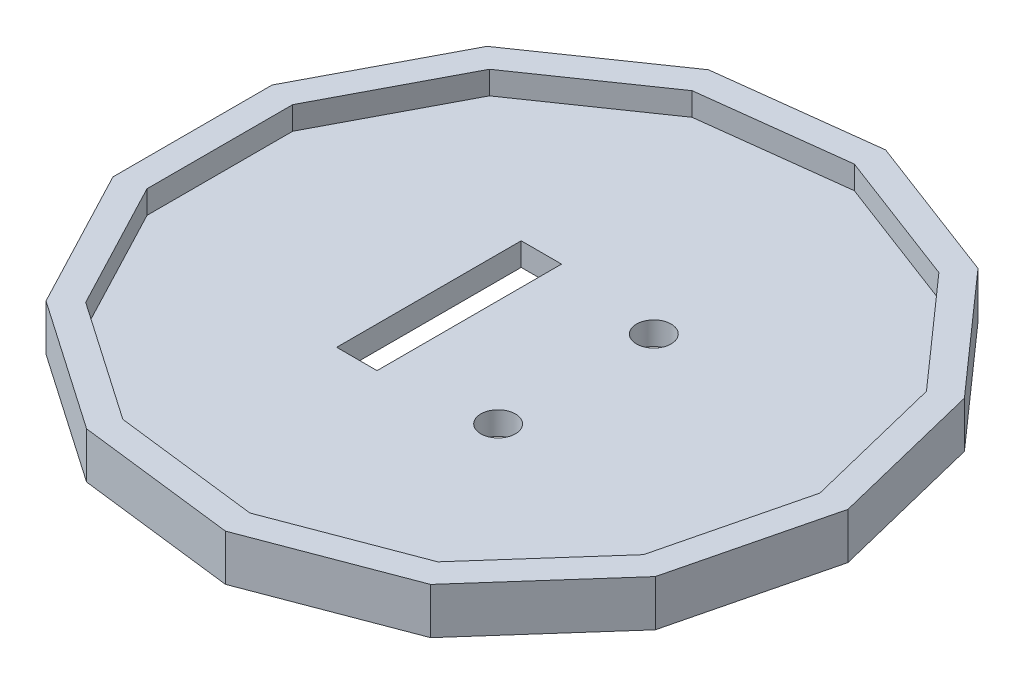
from build123d import *

# Parameters (mm, degrees)
SENSOR_BLOCK_DEPTH    = 4
SENSOR_BASE_CUT_DEPTH = 2
SKETCH9_R             = 1.5
SKETCH9_W             = 3.5
SKETCH9_H             = 16
SENSOR_HOLES_DEPTH    = 2


with BuildPart() as part:
    # Sketch5 → Sensor Block (new body)
    with BuildSketch(Plane(origin=(0, 0, 0), x_dir=(1, 0, 0), z_dir=(0, 1, 0))):
        Polygon((-21.585537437, 19.12311747), (-28, 6.901380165), (-28, -6.901380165), (-21.585537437, -19.12311747), (-10.22608838, -26.96397902), (3.476034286, -28.627717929), (16.381839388, -23.733191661), (25.534762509, -13.4016772), (28.837979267, 0), (25.534762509, 13.4016772), (16.381839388, 23.733191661), (3.476034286, 28.627717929), (-10.22608838, 26.96397902), align=None)
    extrude(amount=SENSOR_BLOCK_DEPTH)

    # Sketch7 → Sensor Base Cut (cut)
    with BuildSketch(Plane(origin=(0, 4, 0), x_dir=(1, 0, 0), z_dir=(0, 1, 0))):
        Polygon((26.4, 0), (23.376039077, 12.268691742), (14.996909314, 21.72677406), (3.182168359, 26.207514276), (-9.361569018, 24.684428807), (-19.760683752, 17.506438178), (-25.63286398, 6.317933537), (-25.63286398, -6.317933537), (-19.760683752, -17.506438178), (-9.361569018, -24.684428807), (3.182168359, -26.207514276), (14.996909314, -21.72677406), (23.376039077, -12.268691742), align=None)
    extrude(amount=-SENSOR_BASE_CUT_DEPTH, mode=Mode.SUBTRACT)

    # Sketch9 → Sensor Holes (cut)
    with BuildSketch(Plane(origin=(0, 0, 0), x_dir=(1, 0, 0), z_dir=(0, 1, 0))):
        with Locations(Location((5.25, 6.75, 0), (0, 0, 270))):
            Circle(SKETCH9_R)
        with Locations(Location((5.25, -6.75, 0), (0, 0, 90))):
            Circle(SKETCH9_R)
        with Locations((-5.75, 0)):
            Rectangle(SKETCH9_W, SKETCH9_H)
    extrude(amount=SENSOR_HOLES_DEPTH, mode=Mode.SUBTRACT)


solid = part.part
